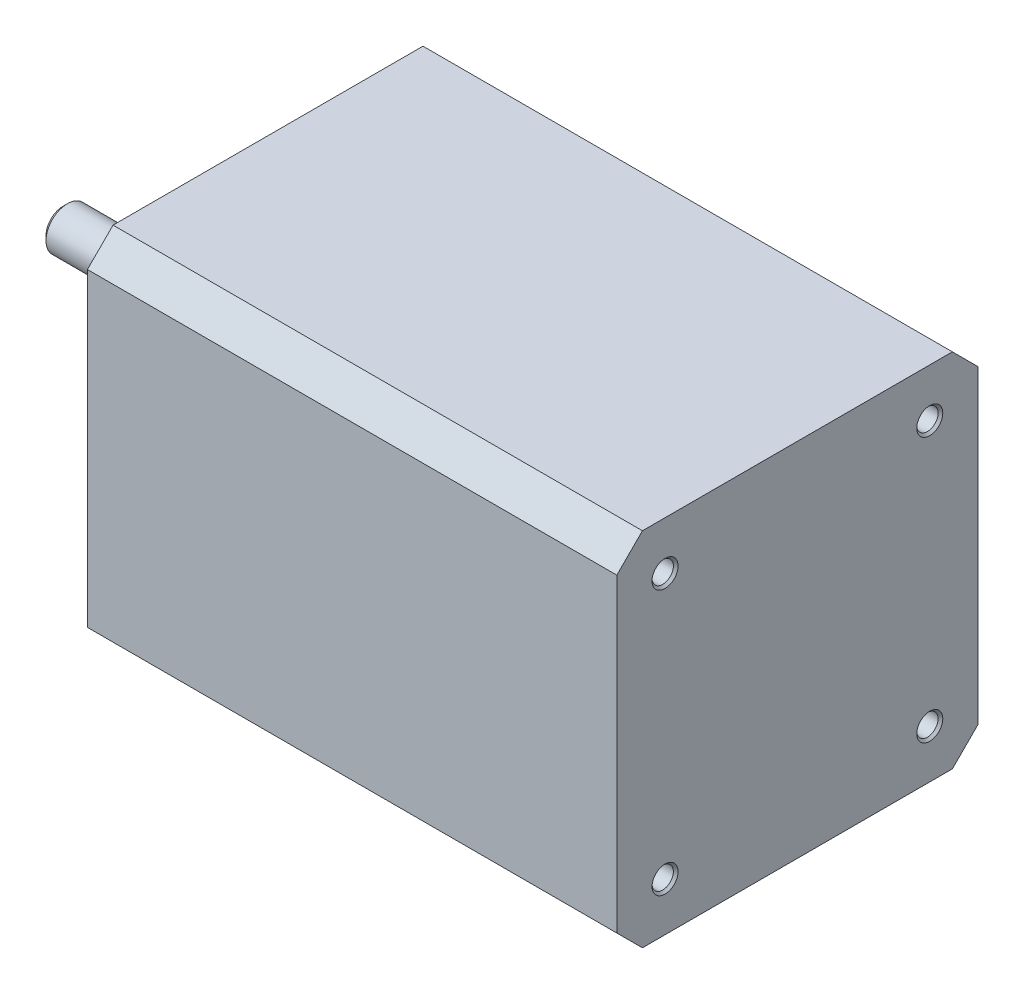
from build123d import *

# Parameters (mm, degrees)
EXTRUDE_1_DEPTH              = 62
SKETCH_2_R                   = 11
EXTRUDE_2_DEPTH              = 2
SKETCH_3_R                   = 2.5
EXTRUDE_3_DEPTH              = 22
CHAMFER_1_SIZE               = 0.5
HOLE_WIZARD_M3_1_D           = 2.5
HOLE_WIZARD_M3_1_CSINK_D     = 3.05
HOLE_WIZARD_M3_1_CSINK_ANGLE = 90


with BuildPart() as part:
    # Sketch 1 → Extrude 1 (new body)
    with BuildSketch(Plane(origin=(0, 0, 0), x_dir=(0, 0, -1), z_dir=(1, 0, 0))):
        Polygon((-21.15, 18.15), (-18.15, 21.15), (18.15, 21.15), (21.15, 18.15), (21.15, -18.15), (18.15, -21.15), (-18.15, -21.15), (-21.15, -18.15), align=None)
    extrude(amount=EXTRUDE_1_DEPTH)

    # Sketch 2 → Extrude 2 (add)
    with BuildSketch(Plane.ZY):
        Circle(SKETCH_2_R)
    extrude(amount=EXTRUDE_2_DEPTH)

    # Sketch 3 → Extrude 3 (add)
    with BuildSketch(Plane.ZY.offset(2)):
        Circle(SKETCH_3_R)
    extrude(amount=EXTRUDE_3_DEPTH)

    # Chamfer 1
    chamfer_1_edges = [part.edges().sort_by_distance(p)[0] for p in [
        (-24, 0, -2.5),
    ]]
    chamfer(chamfer_1_edges, length=CHAMFER_1_SIZE)

    # Hole Wizard M3 _1 (through all)
    with Locations(Plane(origin=(62, 0, 0), x_dir=(0, 0, -1), z_dir=(1, 0, 0))):
        with Locations((15.5, 15.5), (-15.5, 15.5), (-15.5, -15.5), (15.5, -15.5)):
            CounterSinkHole(HOLE_WIZARD_M3_1_D / 2, HOLE_WIZARD_M3_1_CSINK_D / 2, counter_sink_angle=HOLE_WIZARD_M3_1_CSINK_ANGLE)


solid = part.part
